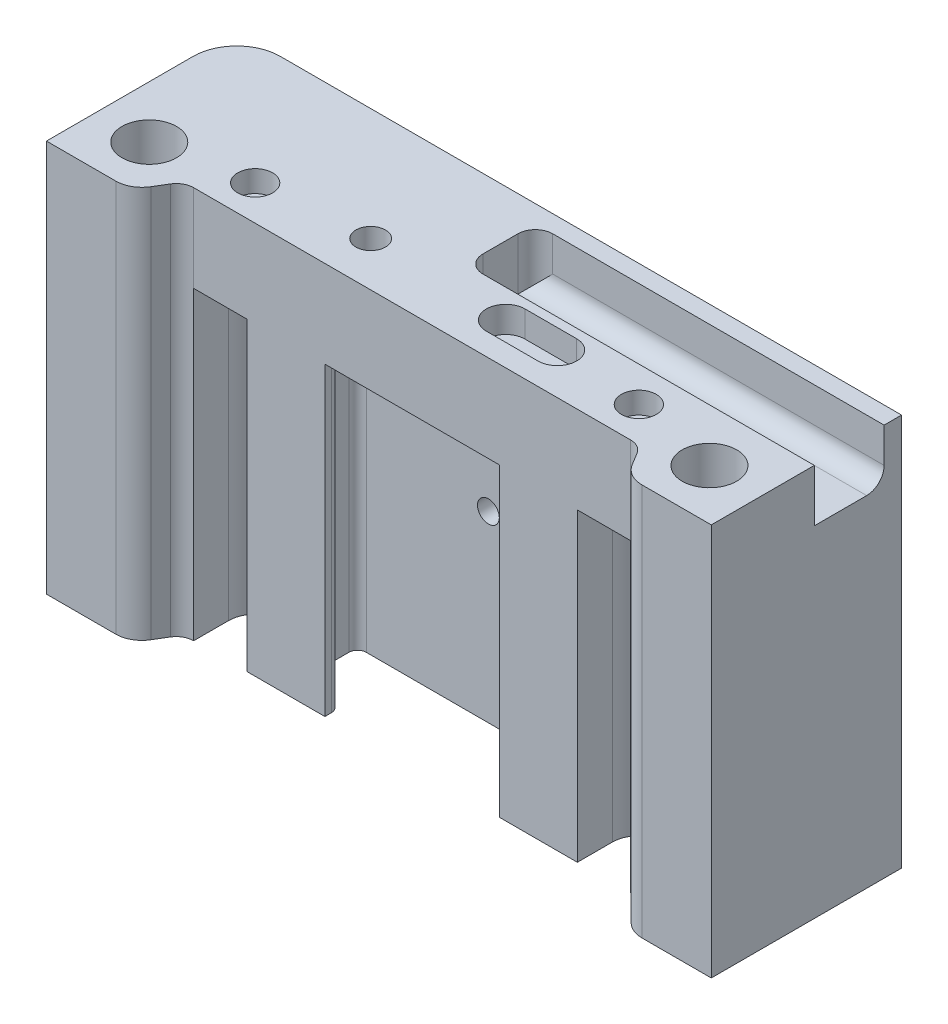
from build123d import *

# Parameters (mm, degrees)
SKETCH1_R                       = 2
SKETCH1_R_2                     = 3.125
SKETCH1_R_3                     = 1.7
BOSS_EXTRUDE1_DEPTH             = 10
FILLET2_R                       = 3
FILLET1_R                       = 2
SKETCH1_4_R                     = 3.125
CUT_EXTRUDE3_DEPTH              = 5.07
SKETCH1_7_R                     = 1.7
CUT_EXTRUDE6_DEPTH              = 10
CUT_EXTRUDE5_DEPTH              = 3
SKETCH1_5_R                     = 2
CUT_EXTRUDE4_DEPTH              = 2.48
SKETCH4_R                       = 1.5
CUT_EXTRUDE7_DEPTH              = 10
SKETCH5_R                       = 2.725
CUT_EXTRUDE8_DEPTH              = 2.8
BOSS_EXTRUDE2_DEPTH             = 10
BOSS_EXTRUDE3_START             = 35
BOSS_EXTRUDE3_DEPTH             = 35
FILLET13_R                      = 5
SKETCH10_W                      = 8
SKETCH10_H                      = 6
CUT_EXTRUDE12_DEPTH             = 40
FILLET14_R                      = 2
CUT_EXTRUDE17_DEPTH             = 35
TAP_DRILL_FOR_M3X0_5_TAP1_D     = 2.5
TAP_DRILL_FOR_M3X0_5_TAP1_DEPTH = 4.248924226
TAP_DRILL_FOR_M3X0_5_TAP1_TIP   = 0.751075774
FILLET15_R                      = 1
SKETCH23_R                      = 3.25
CUT_EXTRUDE20_DEPTH             = 4


with BuildPart() as part:
    # Sketch1 → Boss-Extrude1 (new body)
    # profile 1 of 7: a face of its own
    with BuildSketch(Plane(origin=(0, 0, 0), x_dir=(1, 0, 0), z_dir=(0, 1, 0))):
        with BuildLine():
            ThreePointArc((-11.409245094, 8.977987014), (-9.849239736, 9.28), (-8.289234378, 8.977987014))
            ThreePointArc((-8.289234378, 8.977987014), (-5.835653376, 8.254222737), (-3.289234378, 8.01))
            Line((-3.289234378, 8.01), (38.12, 8.01))
            Line((38.12, 8.01), (38.12, -3.81))
            Line((38.12, -3.81), (28.478275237, -3.81))
            Line((28.478275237, -3.81), (26.178275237, 0))
            Line((26.178275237, 0), (-26.178275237, 0))
            Line((-26.178275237, 0), (-28.478275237, -3.81))
            Line((-28.478275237, -3.81), (-38.12, -3.81))
            Line((-38.12, -3.81), (-38.12, 8.01))
            Line((-38.12, 8.01), (-16.409245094, 8.01))
            ThreePointArc((-16.409245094, 8.01), (-13.862826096, 8.254222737), (-11.409245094, 8.977987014))
        make_face()
        with Locations((22, 4.005)):
            Circle(SKETCH1_R, mode=Mode.SUBTRACT)
        with Locations((-22, 4.005)):
            Circle(SKETCH1_R, mode=Mode.SUBTRACT)
        with Locations((-32.12, 1.98)):
            Circle(SKETCH1_R_2, mode=Mode.SUBTRACT)
        with Locations((32.12, 1.98)):
            Circle(SKETCH1_R_2, mode=Mode.SUBTRACT)
        with Locations((-9.849239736, 5.1)):
            Circle(SKETCH1_R_3, mode=Mode.SUBTRACT)
        with BuildLine():
            ThreePointArc((11.912105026, 2.53), (14.127105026, 4.745), (11.912105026, 6.96))
            Line((11.912105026, 6.96), (5.992105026, 6.96))
            ThreePointArc((5.992105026, 6.96), (3.777105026, 4.745), (5.992105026, 2.53))
            Line((5.992105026, 2.53), (11.912105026, 2.53))
        make_face(mode=Mode.SUBTRACT)
    # profile 2 of 7: a face of its own
    with BuildSketch(Plane(origin=(0, 0, 0), x_dir=(1, 0, 0), z_dir=(0, 1, 0))):
        with Locations((-22, 4.005)):
            Circle(SKETCH1_R)
    # profile 3 of 7: a face of its own
    with BuildSketch(Plane(origin=(0, 0, 0), x_dir=(1, 0, 0), z_dir=(0, 1, 0))):
        with Locations((-9.849239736, 5.1)):
            Circle(SKETCH1_R_3)
    # profile 4 of 7: a face of its own
    with BuildSketch(Plane(origin=(0, 0, 0), x_dir=(1, 0, 0), z_dir=(0, 1, 0))):
        with Locations((-32.12, 1.98)):
            Circle(SKETCH1_R_2)
    # profile 5 of 7: a face of its own
    with BuildSketch(Plane(origin=(0, 0, 0), x_dir=(1, 0, 0), z_dir=(0, 1, 0))):
        with BuildLine():
            Line((5.992105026, 2.53), (11.912105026, 2.53))
            ThreePointArc((11.912105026, 2.53), (14.127105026, 4.745), (11.912105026, 6.96))
            Line((11.912105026, 6.96), (5.992105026, 6.96))
            ThreePointArc((5.992105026, 6.96), (3.777105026, 4.745), (5.992105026, 2.53))
        make_face()
    # profile 6 of 7: a face of its own
    with BuildSketch(Plane(origin=(0, 0, 0), x_dir=(1, 0, 0), z_dir=(0, 1, 0))):
        with Locations((22, 4.005)):
            Circle(SKETCH1_R)
    # profile 7 of 7: a face of its own
    with BuildSketch(Plane(origin=(0, 0, 0), x_dir=(1, 0, 0), z_dir=(0, 1, 0))):
        with Locations((32.12, 1.98)):
            Circle(SKETCH1_R_2)
    extrude(amount=-BOSS_EXTRUDE1_DEPTH)

    # Fillet2
    fillet2_edges = [part.edges().sort_by_distance(p)[0] for p in [
        (28.478275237, -5, 3.81),
        (-28.478275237, -5, 3.81),
    ]]
    fillet(fillet2_edges, radius=FILLET2_R)

    # Fillet1
    fillet1_edges = [part.edges().sort_by_distance(p)[0] for p in [
        (26.178275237, -5, 0),
        (-26.178275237, -5, 0),
    ]]
    fillet(fillet1_edges, radius=FILLET1_R)

    # Sketch1_4 → Cut-Extrude3 (cut)
    with BuildSketch(Plane(origin=(0, 0, 0), x_dir=(1, 0, 0), z_dir=(0, 1, 0))):
        with Locations(Location((32.12, 1.98, 0), (0, 0, 270))):
            Circle(SKETCH1_4_R)
        with Locations(Location((-32.12, 1.98, 0), (0, 0, 270))):
            Circle(SKETCH1_4_R)
    extrude(amount=-CUT_EXTRUDE3_DEPTH, mode=Mode.SUBTRACT)

    # Sketch1_7 → Cut-Extrude6 (cut)
    with BuildSketch(Plane(origin=(0, 0, 0), x_dir=(1, 0, 0), z_dir=(0, 1, 0))):
        with Locations(Location((-9.849239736, 5.1, 0), (0, 0, 270))):
            Circle(SKETCH1_7_R)
    extrude(amount=-CUT_EXTRUDE6_DEPTH, mode=Mode.SUBTRACT)

    # Sketch1_6 → Cut-Extrude5 (cut)
    with BuildSketch(Plane(origin=(0, 0, 0), x_dir=(1, 0, 0), z_dir=(0, 1, 0))):
        with BuildLine():
            Line((5.992105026, 2.53), (11.912105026, 2.53))
            ThreePointArc((11.912105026, 2.53), (14.127105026, 4.745), (11.912105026, 6.96))
            Line((11.912105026, 6.96), (5.992105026, 6.96))
            ThreePointArc((5.992105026, 6.96), (3.777105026, 4.745), (5.992105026, 2.53))
        make_face()
    extrude(amount=-CUT_EXTRUDE5_DEPTH, mode=Mode.SUBTRACT)

    # Sketch1_5 → Cut-Extrude4 (cut)
    with BuildSketch(Plane(origin=(0, 0, 0), x_dir=(1, 0, 0), z_dir=(0, 1, 0))):
        with Locations(Location((-22, 4.005, 0), (0, 0, 270))):
            Circle(SKETCH1_5_R)
        with Locations(Location((22, 4.005, 0), (0, 0, 270))):
            Circle(SKETCH1_5_R)
    extrude(amount=-CUT_EXTRUDE4_DEPTH, mode=Mode.SUBTRACT)

    # Sketch4 → Cut-Extrude7 (cut)
    with BuildSketch(Plane(origin=(0, 0, 0), x_dir=(1, 0, 0), z_dir=(0, 1, 0))):
        with Locations(Location((-22, 4.005, 0), (0, 0, 270))):
            Circle(SKETCH4_R)
        with Locations(Location((22, 4.005, 0), (0, 0, 270))):
            Circle(SKETCH4_R)
    extrude(amount=-CUT_EXTRUDE7_DEPTH, mode=Mode.SUBTRACT)

    # Sketch5 → Cut-Extrude8 (cut)
    with BuildSketch(Plane.XZ.offset(10)):
        with Locations(Location((22, -4.005, 0), (0, 0, 270))):
            Circle(SKETCH5_R)
        with Locations(Location((-22, -4.005, 0), (0, 0, 90))):
            Circle(SKETCH5_R)
    extrude(amount=-CUT_EXTRUDE8_DEPTH, mode=Mode.SUBTRACT)

    # Sketch6 → Boss-Extrude2 (add)
    with BuildSketch(Plane(origin=(0, 0, 0), x_dir=(1, 0, 0), z_dir=(0, 1, 0))):
        with BuildLine():
            Line((-38.12, 8.01), (-38.12, 18.01))
            Line((-38.12, 18.01), (38.12, 18.01))
            Line((38.12, 18.01), (38.12, 8.01))
            Line((38.12, 8.01), (-3.289234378, 8.01))
            ThreePointArc((-3.289234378, 8.01), (-5.835653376, 8.254222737), (-8.289234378, 8.977987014))
            ThreePointArc((-8.289234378, 8.977987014), (-9.849239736, 9.28), (-11.409245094, 8.977987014))
            ThreePointArc((-11.409245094, 8.977987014), (-13.862826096, 8.254222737), (-16.409245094, 8.01))
            Line((-16.409245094, 8.01), (-38.12, 8.01))
        make_face()
    extrude(amount=-BOSS_EXTRUDE2_DEPTH)

    # Sketch8 → Boss-Extrude3 (add)
    with BuildSketch(Plane.XZ.offset(10).offset(BOSS_EXTRUDE3_START)):
        with BuildLine():
            Line((18.950546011, 0), (-18.950546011, 0))
            Line((-18.950546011, 0), (-18.950546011, -4.005))
            ThreePointArc((-18.950546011, -4.005), (-22, -7.054453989), (-25.049453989, -4.005))
            Line((-25.049453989, -4.005), (-25.049453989, 0))
            ThreePointArc((-25.049453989, 0), (-26.032503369, 0.25827272), (-26.761657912, 0.966386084))
            Line((-26.761657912, 0.966386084), (-27.603201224, 2.360420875))
            ThreePointArc((-27.603201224, 2.360420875), (-28.696933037, 3.422590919), (-30.171507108, 3.81))
            Line((-30.171507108, 3.81), (-38.12, 3.81))
            Line((-38.12, 3.81), (-38.12, -18.01))
            Line((-38.12, -18.01), (38.12, -18.01))
            Line((38.12, -18.01), (38.12, 3.81))
            Line((38.12, 3.81), (30.171507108, 3.81))
            ThreePointArc((30.171507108, 3.81), (28.696933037, 3.422590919), (27.603201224, 2.360420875))
            Line((27.603201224, 2.360420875), (26.761657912, 0.966386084))
            ThreePointArc((26.761657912, 0.966386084), (26.032503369, 0.25827272), (25.049453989, 0))
            Line((25.049453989, 0), (25.049453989, -4.005))
            ThreePointArc((25.049453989, -4.005), (22, -7.054453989), (18.950546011, -4.005))
            Line((18.950546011, -4.005), (18.950546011, 0))
        make_face()
    extrude(amount=-BOSS_EXTRUDE3_DEPTH)

    # Fillet13
    fillet13_edges = [part.edges().sort_by_distance(p)[0] for p in [
        (-38.12, -22.5, -18.01),
    ]]
    fillet(fillet13_edges, radius=FILLET13_R)

    # Sketch10 → Cut-Extrude12 (cut)
    with BuildSketch(Plane(origin=(38.12, 0, 0), x_dir=(0, 0, -1), z_dir=(1, 0, 0))):
        with Locations((12.01, -3)):
            Rectangle(SKETCH10_W, SKETCH10_H)
    extrude(amount=-CUT_EXTRUDE12_DEPTH, mode=Mode.SUBTRACT)

    # Fillet14
    fillet14_edges = [part.edges().sort_by_distance(p)[0] for p in [
        (-1.88, -3, -16.01),
        (18.12, -6, -16.01),
        (-1.88, -3, -8.01),
    ]]
    fillet(fillet14_edges, radius=FILLET14_R)

    # Sketch18 → Cut-Extrude17 (cut)
    with BuildSketch(Plane.XZ.offset(45)):
        Polygon((-10, 0), (-10, -1.75), (-15, -1.75), (-15, -8.75), (15, -8.75), (15, -1.75), (10, -1.75), (10, 0), align=None)
    extrude(amount=-CUT_EXTRUDE17_DEPTH, mode=Mode.SUBTRACT)

    # Tap Drill for M3x0.5 Tap1
    with Locations(Plane.XY.offset(-8.75)):
        with Locations((0, -24), (0, -15)):
            Hole(TAP_DRILL_FOR_M3X0_5_TAP1_D / 2, depth=TAP_DRILL_FOR_M3X0_5_TAP1_DEPTH)
            with Locations((0, 0, -(TAP_DRILL_FOR_M3X0_5_TAP1_DEPTH + TAP_DRILL_FOR_M3X0_5_TAP1_TIP / 2))):  # 118° drill point
                Cone(0, TAP_DRILL_FOR_M3X0_5_TAP1_D / 2, TAP_DRILL_FOR_M3X0_5_TAP1_TIP, mode=Mode.SUBTRACT)

    # Fillet15
    fillet15_edges = [part.edges().sort_by_distance(p)[0] for p in [
        (-10, -27.5, -1.75),
        (-15, -27.5, -1.75),
        (-15, -27.5, -8.75),
        (15, -27.5, -8.75),
        (15, -27.5, -1.75),
        (10, -27.5, -1.75),
    ]]
    fillet(fillet15_edges, radius=FILLET15_R)

    # Sketch23 → Cut-Extrude20 (cut)
    with BuildSketch(Plane.XZ.offset(10)):
        with Locations(Location((-9.849239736, -5.1, 0), (0, 0, 270))):
            Circle(SKETCH23_R)
    extrude(amount=-CUT_EXTRUDE20_DEPTH, mode=Mode.SUBTRACT)


solid = part.part
